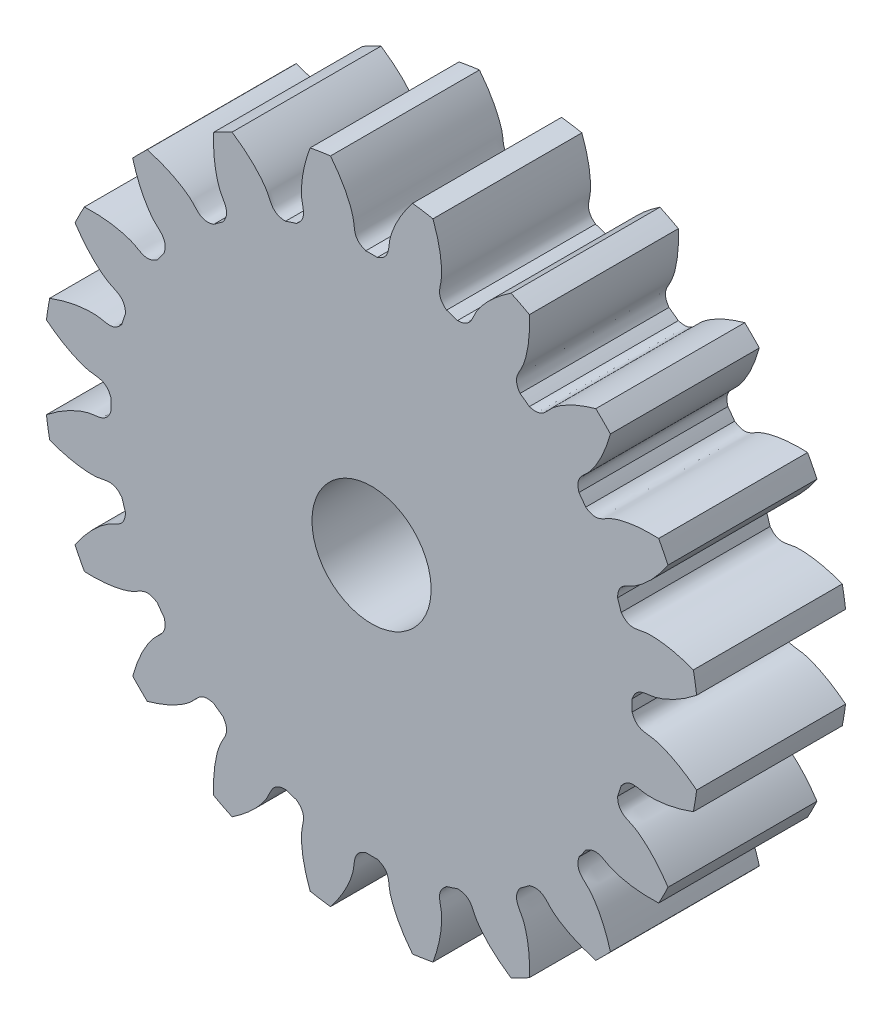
from build123d import *

# Parameters (mm, degrees)
SKETCH_1_R               = 22
EXTRUDE_1_DEPTH          = 10
CUT_EXTRUDE_1_DEPTH      = 33.680269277
PATTERN_CIRCULAR_1_COUNT = 20
SKETCH_4_R               = 4
CUT_EXTRUDE_2_DEPTH      = 10


with BuildPart() as part:
    # Sketch 1 → Extrude 1 (new body)
    with BuildSketch(Plane.XY):
        Circle(SKETCH_1_R)
    extrude(amount=EXTRUDE_1_DEPTH)

    # Sketch 2 → Cut-Extrude 1 (cut, through all)
    with BuildSketch(Plane.XY):
        with BuildLine():
            ThreePointArc((0.386633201, 17.495728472), (0, 17.5), (-0.386633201, 17.495728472))
            add(Edge.make_bspline(
                [(-0.386633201, 17.495728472), (-1.22237881, 17.786951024), (-1.114168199, 18.374227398), (-1.225794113, 18.940018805), (-1.237784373, 18.995113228), (-1.25262178, 19.05726923), (-1.270584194, 19.126393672), (-1.29195828, 19.202382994), (-1.31702411, 19.285125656), (-1.346059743, 19.374501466), (-1.3793395, 19.470381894), (-1.4171342, 19.57263009), (-1.459710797, 19.681101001), (-1.507332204, 19.795641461), (-1.560257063, 19.916090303), (-1.618739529, 20.042278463), (-1.683029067, 20.174029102), (-1.753370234, 20.311157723), (-1.830002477, 20.4534723), (-1.913159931, 20.600773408), (-2.003071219, 20.752854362), (-2.099959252, 20.909501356), (-2.204041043, 21.070493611), (-2.315527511, 21.235603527), (-2.434623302, 21.404596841), (-2.561526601, 21.577232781), (-2.696428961, 21.753264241), (-2.839515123, 21.932437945), (-2.990962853, 22.114494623), (-3.15094277, 22.299169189), (-3.319618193, 22.486190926), (-3.497144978, 22.67528367), (-3.683671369, 22.866166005), (-3.879337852, 23.058551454), (-4.084277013, 23.252148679), (-4.298613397, 23.446661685), (-4.522463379, 23.641790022), (-4.755935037, 23.837228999), (-4.999128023, 24.032669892), (-5.252133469, 24.227800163), (-5.515033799, 24.42230368), (-5.882947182, 24.683279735), (-6.167864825, 24.872665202), (-6.362315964, 24.996503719)],
                knots=[0, 0, 0, 0, 0.165916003, 0.170905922, 0.176663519, 0.183188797, 0.190481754, 0.198542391, 0.207370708, 0.216966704, 0.22733038, 0.238461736, 0.250360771, 0.263027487, 0.276461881, 0.290663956, 0.30563371, 0.321371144, 0.337876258, 0.355149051, 0.373189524, 0.391997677, 0.411573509, 0.431917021, 0.453028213, 0.474907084, 0.497553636, 0.520967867, 0.545149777, 0.570099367, 0.595816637, 0.622301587, 0.649554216, 0.677574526, 0.706362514, 0.735918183, 0.766241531, 0.797332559, 0.829191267, 0.861817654, 0.895211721, 0.929373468, 1, 1, 1, 1], degree=3))
            ThreePointArc((-6.362315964, 24.996503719), (0, 25.793492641), (6.362315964, 24.996503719))
            add(Edge.make_bspline(
                [(0.386633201, 17.495728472), (1.22237881, 17.786951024), (1.114168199, 18.374227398), (1.225794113, 18.940018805), (1.237784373, 18.995113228), (1.25262178, 19.05726923), (1.270584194, 19.126393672), (1.29195828, 19.202382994), (1.31702411, 19.285125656), (1.346059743, 19.374501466), (1.3793395, 19.470381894), (1.4171342, 19.57263009), (1.459710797, 19.681101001), (1.507332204, 19.795641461), (1.560257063, 19.916090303), (1.618739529, 20.042278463), (1.683029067, 20.174029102), (1.753370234, 20.311157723), (1.830002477, 20.4534723), (1.913159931, 20.600773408), (2.003071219, 20.752854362), (2.099959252, 20.909501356), (2.204041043, 21.070493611), (2.315527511, 21.235603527), (2.434623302, 21.404596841), (2.561526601, 21.577232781), (2.696428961, 21.753264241), (2.839515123, 21.932437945), (2.990962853, 22.114494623), (3.15094277, 22.299169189), (3.319618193, 22.486190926), (3.497144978, 22.67528367), (3.683671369, 22.866166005), (3.879337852, 23.058551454), (4.084277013, 23.252148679), (4.298613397, 23.446661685), (4.522463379, 23.641790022), (4.755935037, 23.837228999), (4.999128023, 24.032669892), (5.252133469, 24.227800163), (5.515033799, 24.42230368), (5.882947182, 24.683279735), (6.167864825, 24.872665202), (6.362315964, 24.996503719)],
                knots=[0, 0, 0, 0, 0.165916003, 0.170905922, 0.176663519, 0.183188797, 0.190481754, 0.198542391, 0.207370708, 0.216966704, 0.22733038, 0.238461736, 0.250360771, 0.263027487, 0.276461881, 0.290663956, 0.30563371, 0.321371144, 0.337876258, 0.355149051, 0.373189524, 0.391997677, 0.411573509, 0.431917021, 0.453028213, 0.474907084, 0.497553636, 0.520967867, 0.545149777, 0.570099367, 0.595816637, 0.622301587, 0.649554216, 0.677574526, 0.706362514, 0.735918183, 0.766241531, 0.797332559, 0.829191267, 0.861817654, 0.895211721, 0.929373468, 1, 1, 1, 1], degree=3))
        make_face()
    cut_extrude_1 = extrude(amount=CUT_EXTRUDE_1_DEPTH, mode=Mode.SUBTRACT)

    # Pattern Circular 1: Cut-Extrude 1 ×20 about axis
    pattern_circular_1_axis = Axis((0, 0, 10), (0, 0, -1))
    for i in range(1, PATTERN_CIRCULAR_1_COUNT):
        add(cut_extrude_1.rotate(pattern_circular_1_axis, i * 360 / PATTERN_CIRCULAR_1_COUNT), mode=Mode.SUBTRACT)

    # Sketch 4 → Cut-Extrude 2 (cut)
    with BuildSketch(Plane(origin=(0, 0, 0), x_dir=(-1, 0, 0), z_dir=(0, 0, -1))):
        Circle(SKETCH_4_R)
    extrude(amount=-CUT_EXTRUDE_2_DEPTH, mode=Mode.SUBTRACT)


solid = part.part
